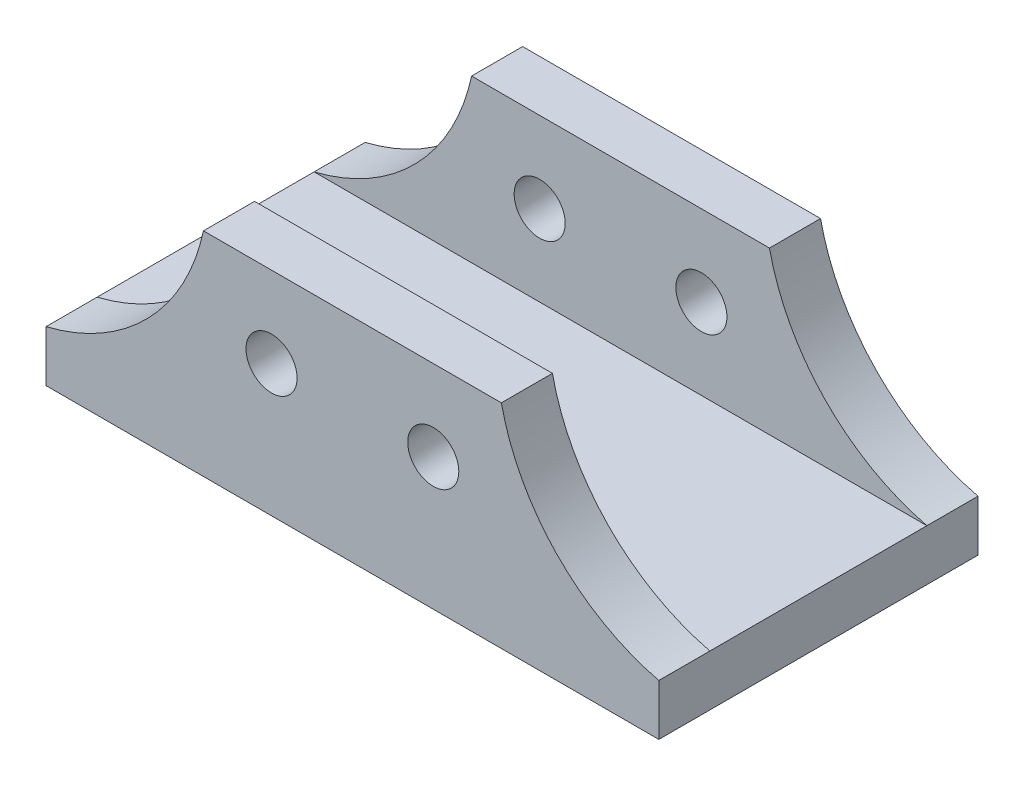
ISO-10303-21;
HEADER;
FILE_DESCRIPTION(('STEP AP214'),'2;1');
FILE_NAME('part.step','',(''),(''),'','','');
FILE_SCHEMA(('AUTOMOTIVE_DESIGN { 1 0 10303 214 1 1 1 1 }'));
ENDSEC;
DATA;
#1=APPLICATION_CONTEXT('core data for automotive mechanical design processes');
#2=APPLICATION_PROTOCOL_DEFINITION('international standard','automotive_design',2000,#1);
#3=PRODUCT_CONTEXT('',#1,'mechanical');
#4=PRODUCT('Part','Part','',(#3));
#5=PRODUCT_RELATED_PRODUCT_CATEGORY('part','',(#4));
#6=PRODUCT_DEFINITION_FORMATION('','',#4);
#7=PRODUCT_DEFINITION_CONTEXT('part definition',#1,'design');
#8=PRODUCT_DEFINITION('design','',#6,#7);
#9=PRODUCT_DEFINITION_SHAPE('','',#8);
#10=(LENGTH_UNIT() NAMED_UNIT(*) SI_UNIT(.MILLI.,.METRE.));
#11=(NAMED_UNIT(*) PLANE_ANGLE_UNIT() SI_UNIT($,.RADIAN.));
#12=(NAMED_UNIT(*) SI_UNIT($,.STERADIAN.) SOLID_ANGLE_UNIT());
#13=UNCERTAINTY_MEASURE_WITH_UNIT(LENGTH_MEASURE(1.E-05),#10,'distance_accuracy_value','');
#14=(GEOMETRIC_REPRESENTATION_CONTEXT(3) GLOBAL_UNCERTAINTY_ASSIGNED_CONTEXT((#13)) GLOBAL_UNIT_ASSIGNED_CONTEXT((#10,
#11,#12)) REPRESENTATION_CONTEXT('',''));
#15=CARTESIAN_POINT('',(0.,0.,0.));
#16=DIRECTION('',(0.,0.,1.));
#17=DIRECTION('',(1.,0.,0.));
#18=AXIS2_PLACEMENT_3D('',#15,#16,#17);
#19=CARTESIAN_POINT('',(83.8698437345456,60.5706373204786,12.));
#20=DIRECTION('',(0.,0.,-1.));
#21=DIRECTION('',(-1.,0.,0.));
#22=AXIS2_PLACEMENT_3D('',#19,#20,#21);
#23=PLANE('',#22);
#24=CARTESIAN_POINT('',(-19.,31.,12.));
#25=DIRECTION('',(0.,0.,1.));
#26=DIRECTION('',(-1.,0.,0.));
#27=AXIS2_PLACEMENT_3D('',#24,#25,#26);
#28=CIRCLE('',#27,6.00000000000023);
#29=CARTESIAN_POINT('',(-25.0000000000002,31.,12.));
#30=VERTEX_POINT('',#29);
#31=EDGE_CURVE('E182',#30,#30,#28,.T.);
#32=ORIENTED_EDGE('',*,*,#31,.F.);
#33=EDGE_LOOP('',(#32));
#34=FACE_BOUND('',#33,.T.);
#35=CARTESIAN_POINT('',(19.,31.,12.));
#36=DIRECTION('',(0.,0.,1.));
#37=DIRECTION('',(1.,0.,0.));
#38=AXIS2_PLACEMENT_3D('',#35,#36,#37);
#39=CIRCLE('',#38,6.00000000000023);
#40=CARTESIAN_POINT('',(25.0000000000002,31.,12.));
#41=VERTEX_POINT('',#40);
#42=EDGE_CURVE('E188',#41,#41,#39,.T.);
#43=ORIENTED_EDGE('',*,*,#42,.F.);
#44=EDGE_LOOP('',(#43));
#45=FACE_BOUND('',#44,.T.);
#46=DIRECTION('',(-1.,0.,0.));
#47=VECTOR('',#46,1.);
#48=CARTESIAN_POINT('',(-72.,12.,12.));
#49=LINE('',#48,#47);
#50=CARTESIAN_POINT('',(72.,12.,12.));
#51=VERTEX_POINT('',#50);
#52=CARTESIAN_POINT('',(-72.,12.,12.));
#53=VERTEX_POINT('',#52);
#54=EDGE_CURVE('E91',#51,#53,#49,.T.);
#55=ORIENTED_EDGE('',*,*,#54,.F.);
#56=CARTESIAN_POINT('',(83.8698437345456,60.5706373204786,12.));
#57=DIRECTION('',(0.,0.,-1.));
#58=DIRECTION('',(-1.,0.,0.));
#59=AXIS2_PLACEMENT_3D('',#56,#57,#58);
#60=CIRCLE('',#59,50.);
#61=CARTESIAN_POINT('',(35.,50.,12.));
#62=VERTEX_POINT('',#61);
#63=EDGE_CURVE('E194',#51,#62,#60,.T.);
#64=ORIENTED_EDGE('',*,*,#63,.T.);
#65=DIRECTION('',(-1.,0.,0.));
#66=VECTOR('',#65,1.);
#67=CARTESIAN_POINT('',(-35.,50.,12.));
#68=LINE('',#67,#66);
#69=CARTESIAN_POINT('',(-35.,50.,12.));
#70=VERTEX_POINT('',#69);
#71=EDGE_CURVE('E57',#62,#70,#68,.T.);
#72=ORIENTED_EDGE('',*,*,#71,.T.);
#73=CARTESIAN_POINT('',(-83.8698437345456,60.5706373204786,12.));
#74=DIRECTION('',(0.,0.,-1.));
#75=DIRECTION('',(1.,0.,0.));
#76=AXIS2_PLACEMENT_3D('',#73,#74,#75);
#77=CIRCLE('',#76,50.);
#78=EDGE_CURVE('E197',#70,#53,#77,.T.);
#79=ORIENTED_EDGE('',*,*,#78,.T.);
#80=EDGE_LOOP('',(#55,#64,#72,#79));
#81=FACE_BOUND('',#80,.T.);
#82=ADVANCED_FACE('F40',(#34,#45,#81),#23,.F.);
#83=CARTESIAN_POINT('',(83.8698437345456,60.5706373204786,0.));
#84=DIRECTION('',(0.,0.,-1.));
#85=DIRECTION('',(-1.,0.,0.));
#86=AXIS2_PLACEMENT_3D('',#83,#84,#85);
#87=PLANE('',#86);
#88=CARTESIAN_POINT('',(19.,31.,0.));
#89=DIRECTION('',(0.,0.,1.));
#90=DIRECTION('',(1.,0.,0.));
#91=AXIS2_PLACEMENT_3D('',#88,#89,#90);
#92=CIRCLE('',#91,6.00000000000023);
#93=CARTESIAN_POINT('',(25.0000000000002,31.,0.));
#94=VERTEX_POINT('',#93);
#95=EDGE_CURVE('E185',#94,#94,#92,.T.);
#96=ORIENTED_EDGE('',*,*,#95,.T.);
#97=EDGE_LOOP('',(#96));
#98=FACE_BOUND('',#97,.T.);
#99=DIRECTION('',(0.,1.,0.));
#100=VECTOR('',#99,1.);
#101=CARTESIAN_POINT('',(72.,0.,0.));
#102=LINE('',#101,#100);
#103=CARTESIAN_POINT('',(72.,0.,0.));
#104=VERTEX_POINT('',#103);
#105=CARTESIAN_POINT('',(72.,12.,0.));
#106=VERTEX_POINT('',#105);
#107=EDGE_CURVE('E191',#104,#106,#102,.T.);
#108=ORIENTED_EDGE('',*,*,#107,.F.);
#109=DIRECTION('',(1.,0.,0.));
#110=VECTOR('',#109,1.);
#111=CARTESIAN_POINT('',(-72.,0.,0.));
#112=LINE('',#111,#110);
#113=CARTESIAN_POINT('',(-72.,0.,0.));
#114=VERTEX_POINT('',#113);
#115=EDGE_CURVE('E87',#114,#104,#112,.T.);
#116=ORIENTED_EDGE('',*,*,#115,.F.);
#117=DIRECTION('',(0.,-1.,0.));
#118=VECTOR('',#117,1.);
#119=CARTESIAN_POINT('',(-72.,0.,0.));
#120=LINE('',#119,#118);
#121=CARTESIAN_POINT('',(-72.,12.,0.));
#122=VERTEX_POINT('',#121);
#123=EDGE_CURVE('E81',#122,#114,#120,.T.);
#124=ORIENTED_EDGE('',*,*,#123,.F.);
#125=CARTESIAN_POINT('',(-83.8698437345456,60.5706373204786,0.));
#126=DIRECTION('',(0.,0.,-1.));
#127=DIRECTION('',(1.,0.,0.));
#128=AXIS2_PLACEMENT_3D('',#125,#126,#127);
#129=CIRCLE('',#128,50.);
#130=CARTESIAN_POINT('',(-35.,50.,0.));
#131=VERTEX_POINT('',#130);
#132=EDGE_CURVE('E206',#131,#122,#129,.T.);
#133=ORIENTED_EDGE('',*,*,#132,.F.);
#134=DIRECTION('',(-1.,0.,0.));
#135=VECTOR('',#134,1.);
#136=CARTESIAN_POINT('',(-35.,50.,0.));
#137=LINE('',#136,#135);
#138=CARTESIAN_POINT('',(35.,50.,0.));
#139=VERTEX_POINT('',#138);
#140=EDGE_CURVE('E204',#139,#131,#137,.T.);
#141=ORIENTED_EDGE('',*,*,#140,.F.);
#142=CARTESIAN_POINT('',(83.8698437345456,60.5706373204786,0.));
#143=DIRECTION('',(0.,0.,-1.));
#144=DIRECTION('',(-1.,0.,0.));
#145=AXIS2_PLACEMENT_3D('',#142,#143,#144);
#146=CIRCLE('',#145,50.);
#147=EDGE_CURVE('E202',#106,#139,#146,.T.);
#148=ORIENTED_EDGE('',*,*,#147,.F.);
#149=EDGE_LOOP('',(#108,#116,#124,#133,#141,#148));
#150=FACE_BOUND('',#149,.T.);
#151=CARTESIAN_POINT('',(-19.,31.,0.));
#152=DIRECTION('',(0.,0.,1.));
#153=DIRECTION('',(-1.,0.,0.));
#154=AXIS2_PLACEMENT_3D('',#151,#152,#153);
#155=CIRCLE('',#154,6.00000000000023);
#156=CARTESIAN_POINT('',(-25.0000000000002,31.,0.));
#157=VERTEX_POINT('',#156);
#158=EDGE_CURVE('E180',#157,#157,#155,.T.);
#159=ORIENTED_EDGE('',*,*,#158,.T.);
#160=EDGE_LOOP('',(#159));
#161=FACE_BOUND('',#160,.T.);
#162=ADVANCED_FACE('F226',(#98,#150,#161),#87,.T.);
#163=CARTESIAN_POINT('',(72.,0.,12.));
#164=DIRECTION('',(-1.,0.,0.));
#165=DIRECTION('',(0.,0.,1.));
#166=AXIS2_PLACEMENT_3D('',#163,#164,#165);
#167=PLANE('',#166);
#168=ORIENTED_EDGE('',*,*,#107,.T.);
#169=DIRECTION('',(0.,0.,-1.));
#170=VECTOR('',#169,1.);
#171=CARTESIAN_POINT('',(72.,12.,12.));
#172=LINE('',#171,#170);
#173=EDGE_CURVE('E11',#51,#106,#172,.T.);
#174=ORIENTED_EDGE('',*,*,#173,.F.);
#175=DIRECTION('',(0.,0.,1.));
#176=VECTOR('',#175,1.);
#177=CARTESIAN_POINT('',(72.,12.,-132.499134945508));
#178=LINE('',#177,#176);
#179=CARTESIAN_POINT('',(72.,12.,63.));
#180=VERTEX_POINT('',#179);
#181=EDGE_CURVE('E176',#51,#180,#178,.T.);
#182=ORIENTED_EDGE('',*,*,#181,.T.);
#183=DIRECTION('',(0.,0.,1.));
#184=VECTOR('',#183,1.);
#185=CARTESIAN_POINT('',(72.,12.,63.));
#186=LINE('',#185,#184);
#187=CARTESIAN_POINT('',(72.,12.,75.));
#188=VERTEX_POINT('',#187);
#189=EDGE_CURVE('E137',#180,#188,#186,.T.);
#190=ORIENTED_EDGE('',*,*,#189,.T.);
#191=DIRECTION('',(0.,1.,0.));
#192=VECTOR('',#191,1.);
#193=CARTESIAN_POINT('',(72.,0.,75.));
#194=LINE('',#193,#192);
#195=CARTESIAN_POINT('',(72.,0.,75.));
#196=VERTEX_POINT('',#195);
#197=EDGE_CURVE('E156',#196,#188,#194,.T.);
#198=ORIENTED_EDGE('',*,*,#197,.F.);
#199=DIRECTION('',(0.,0.,-1.));
#200=VECTOR('',#199,1.);
#201=CARTESIAN_POINT('',(72.,0.,12.));
#202=LINE('',#201,#200);
#203=EDGE_CURVE('E199',#196,#104,#202,.T.);
#204=ORIENTED_EDGE('',*,*,#203,.T.);
#205=EDGE_LOOP('',(#168,#174,#182,#190,#198,#204));
#206=FACE_BOUND('',#205,.T.);
#207=ADVANCED_FACE('F42',(#206),#167,.F.);
#208=CARTESIAN_POINT('',(83.8698437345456,60.5706373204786,12.));
#209=DIRECTION('',(0.,0.,-1.));
#210=DIRECTION('',(-1.,0.,0.));
#211=AXIS2_PLACEMENT_3D('',#208,#209,#210);
#212=CYLINDRICAL_SURFACE('',#211,50.);
#213=ORIENTED_EDGE('',*,*,#147,.T.);
#214=DIRECTION('',(0.,0.,-1.));
#215=VECTOR('',#214,1.);
#216=CARTESIAN_POINT('',(35.,50.,12.));
#217=LINE('',#216,#215);
#218=EDGE_CURVE('E49',#62,#139,#217,.T.);
#219=ORIENTED_EDGE('',*,*,#218,.F.);
#220=ORIENTED_EDGE('',*,*,#63,.F.);
#221=ORIENTED_EDGE('',*,*,#173,.T.);
#222=EDGE_LOOP('',(#213,#219,#220,#221));
#223=FACE_BOUND('',#222,.T.);
#224=ADVANCED_FACE('F242',(#223),#212,.F.);
#225=CARTESIAN_POINT('',(-35.,50.,12.));
#226=DIRECTION('',(0.,-1.,0.));
#227=DIRECTION('',(0.,0.,-1.));
#228=AXIS2_PLACEMENT_3D('',#225,#226,#227);
#229=PLANE('',#228);
#230=ORIENTED_EDGE('',*,*,#140,.T.);
#231=DIRECTION('',(0.,0.,-1.));
#232=VECTOR('',#231,1.);
#233=CARTESIAN_POINT('',(-35.,50.,12.));
#234=LINE('',#233,#232);
#235=EDGE_CURVE('E215',#70,#131,#234,.T.);
#236=ORIENTED_EDGE('',*,*,#235,.F.);
#237=ORIENTED_EDGE('',*,*,#71,.F.);
#238=ORIENTED_EDGE('',*,*,#218,.T.);
#239=EDGE_LOOP('',(#230,#236,#237,#238));
#240=FACE_BOUND('',#239,.T.);
#241=ADVANCED_FACE('F221',(#240),#229,.F.);
#242=CARTESIAN_POINT('',(-83.8698437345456,60.5706373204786,12.));
#243=DIRECTION('',(0.,0.,-1.));
#244=DIRECTION('',(-1.,0.,0.));
#245=AXIS2_PLACEMENT_3D('',#242,#243,#244);
#246=CYLINDRICAL_SURFACE('',#245,50.);
#247=ORIENTED_EDGE('',*,*,#132,.T.);
#248=DIRECTION('',(0.,0.,-1.));
#249=VECTOR('',#248,1.);
#250=CARTESIAN_POINT('',(-72.,12.,12.));
#251=LINE('',#250,#249);
#252=EDGE_CURVE('E213',#53,#122,#251,.T.);
#253=ORIENTED_EDGE('',*,*,#252,.F.);
#254=ORIENTED_EDGE('',*,*,#78,.F.);
#255=ORIENTED_EDGE('',*,*,#235,.T.);
#256=EDGE_LOOP('',(#247,#253,#254,#255));
#257=FACE_BOUND('',#256,.T.);
#258=ADVANCED_FACE('F229',(#257),#246,.F.);
#259=CARTESIAN_POINT('',(-72.,0.,12.));
#260=DIRECTION('',(1.,0.,0.));
#261=DIRECTION('',(0.,0.,-1.));
#262=AXIS2_PLACEMENT_3D('',#259,#260,#261);
#263=PLANE('',#262);
#264=ORIENTED_EDGE('',*,*,#123,.T.);
#265=DIRECTION('',(0.,0.,-1.));
#266=VECTOR('',#265,1.);
#267=CARTESIAN_POINT('',(-72.,0.,12.));
#268=LINE('',#267,#266);
#269=CARTESIAN_POINT('',(-72.,0.,75.));
#270=VERTEX_POINT('',#269);
#271=EDGE_CURVE('E211',#270,#114,#268,.T.);
#272=ORIENTED_EDGE('',*,*,#271,.F.);
#273=DIRECTION('',(0.,-1.,0.));
#274=VECTOR('',#273,1.);
#275=CARTESIAN_POINT('',(-72.,0.,75.));
#276=LINE('',#275,#274);
#277=CARTESIAN_POINT('',(-72.,12.,75.));
#278=VERTEX_POINT('',#277);
#279=EDGE_CURVE('E166',#278,#270,#276,.T.);
#280=ORIENTED_EDGE('',*,*,#279,.F.);
#281=DIRECTION('',(0.,0.,1.));
#282=VECTOR('',#281,1.);
#283=CARTESIAN_POINT('',(-72.,12.,63.));
#284=LINE('',#283,#282);
#285=CARTESIAN_POINT('',(-72.,12.,63.));
#286=VERTEX_POINT('',#285);
#287=EDGE_CURVE('E152',#286,#278,#284,.T.);
#288=ORIENTED_EDGE('',*,*,#287,.F.);
#289=DIRECTION('',(0.,0.,1.));
#290=VECTOR('',#289,1.);
#291=CARTESIAN_POINT('',(-72.,12.,-132.499134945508));
#292=LINE('',#291,#290);
#293=EDGE_CURVE('E178',#53,#286,#292,.T.);
#294=ORIENTED_EDGE('',*,*,#293,.F.);
#295=ORIENTED_EDGE('',*,*,#252,.T.);
#296=EDGE_LOOP('',(#264,#272,#280,#288,#294,#295));
#297=FACE_BOUND('',#296,.T.);
#298=ADVANCED_FACE('F232',(#297),#263,.F.);
#299=CARTESIAN_POINT('',(-72.,0.,12.));
#300=DIRECTION('',(0.,1.,0.));
#301=DIRECTION('',(0.,0.,1.));
#302=AXIS2_PLACEMENT_3D('',#299,#300,#301);
#303=PLANE('',#302);
#304=ORIENTED_EDGE('',*,*,#115,.T.);
#305=ORIENTED_EDGE('',*,*,#203,.F.);
#306=DIRECTION('',(1.,0.,0.));
#307=VECTOR('',#306,1.);
#308=CARTESIAN_POINT('',(-72.,0.,75.));
#309=LINE('',#308,#307);
#310=EDGE_CURVE('E146',#270,#196,#309,.T.);
#311=ORIENTED_EDGE('',*,*,#310,.F.);
#312=ORIENTED_EDGE('',*,*,#271,.T.);
#313=EDGE_LOOP('',(#304,#305,#311,#312));
#314=FACE_BOUND('',#313,.T.);
#315=ADVANCED_FACE('F257',(#314),#303,.F.);
#316=CARTESIAN_POINT('',(19.,31.,12.));
#317=DIRECTION('',(0.,0.,-1.));
#318=DIRECTION('',(-1.,0.,0.));
#319=AXIS2_PLACEMENT_3D('',#316,#317,#318);
#320=CYLINDRICAL_SURFACE('',#319,6.00000000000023);
#321=ORIENTED_EDGE('',*,*,#42,.T.);
#322=EDGE_LOOP('',(#321));
#323=FACE_BOUND('',#322,.T.);
#324=ORIENTED_EDGE('',*,*,#95,.F.);
#325=EDGE_LOOP('',(#324));
#326=FACE_BOUND('',#325,.T.);
#327=ADVANCED_FACE('F254',(#323,#326),#320,.F.);
#328=CARTESIAN_POINT('',(-19.,31.,12.));
#329=DIRECTION('',(0.,0.,-1.));
#330=DIRECTION('',(-1.,0.,0.));
#331=AXIS2_PLACEMENT_3D('',#328,#329,#330);
#332=CYLINDRICAL_SURFACE('',#331,6.00000000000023);
#333=ORIENTED_EDGE('',*,*,#31,.T.);
#334=EDGE_LOOP('',(#333));
#335=FACE_BOUND('',#334,.T.);
#336=ORIENTED_EDGE('',*,*,#158,.F.);
#337=EDGE_LOOP('',(#336));
#338=FACE_BOUND('',#337,.T.);
#339=ADVANCED_FACE('F284',(#335,#338),#332,.F.);
#340=CARTESIAN_POINT('',(-72.,12.,-132.499134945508));
#341=DIRECTION('',(0.,1.,0.));
#342=DIRECTION('',(0.,0.,1.));
#343=AXIS2_PLACEMENT_3D('',#340,#341,#342);
#344=PLANE('',#343);
#345=ORIENTED_EDGE('',*,*,#181,.F.);
#346=ORIENTED_EDGE('',*,*,#54,.T.);
#347=ORIENTED_EDGE('',*,*,#293,.T.);
#348=DIRECTION('',(-1.,0.,0.));
#349=VECTOR('',#348,1.);
#350=CARTESIAN_POINT('',(-72.,12.,63.));
#351=LINE('',#350,#349);
#352=EDGE_CURVE('E174',#180,#286,#351,.T.);
#353=ORIENTED_EDGE('',*,*,#352,.F.);
#354=EDGE_LOOP('',(#345,#346,#347,#353));
#355=FACE_BOUND('',#354,.T.);
#356=ADVANCED_FACE('F238',(#355),#344,.T.);
#357=CARTESIAN_POINT('',(83.8698437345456,60.5706373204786,63.));
#358=DIRECTION('',(0.,0.,1.));
#359=DIRECTION('',(-1.,0.,0.));
#360=AXIS2_PLACEMENT_3D('',#357,#358,#359);
#361=PLANE('',#360);
#362=CARTESIAN_POINT('',(19.,31.,63.));
#363=DIRECTION('',(0.,0.,1.));
#364=DIRECTION('',(1.,0.,0.));
#365=AXIS2_PLACEMENT_3D('',#362,#363,#364);
#366=CIRCLE('',#365,6.00000000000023);
#367=CARTESIAN_POINT('',(25.0000000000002,31.,63.));
#368=VERTEX_POINT('',#367);
#369=EDGE_CURVE('E160',#368,#368,#366,.T.);
#370=ORIENTED_EDGE('',*,*,#369,.T.);
#371=EDGE_LOOP('',(#370));
#372=FACE_BOUND('',#371,.T.);
#373=CARTESIAN_POINT('',(-19.,31.,63.));
#374=DIRECTION('',(0.,0.,1.));
#375=DIRECTION('',(-1.,0.,0.));
#376=AXIS2_PLACEMENT_3D('',#373,#374,#375);
#377=CIRCLE('',#376,6.00000000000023);
#378=CARTESIAN_POINT('',(-25.0000000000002,31.,63.));
#379=VERTEX_POINT('',#378);
#380=EDGE_CURVE('E469',#379,#379,#377,.T.);
#381=ORIENTED_EDGE('',*,*,#380,.T.);
#382=EDGE_LOOP('',(#381));
#383=FACE_BOUND('',#382,.T.);
#384=CARTESIAN_POINT('',(83.8698437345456,60.5706373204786,63.));
#385=DIRECTION('',(0.,0.,-1.));
#386=DIRECTION('',(-1.,0.,0.));
#387=AXIS2_PLACEMENT_3D('',#384,#385,#386);
#388=CIRCLE('',#387,50.);
#389=CARTESIAN_POINT('',(35.,50.,63.));
#390=VERTEX_POINT('',#389);
#391=EDGE_CURVE('E142',#180,#390,#388,.T.);
#392=ORIENTED_EDGE('',*,*,#391,.F.);
#393=ORIENTED_EDGE('',*,*,#352,.T.);
#394=CARTESIAN_POINT('',(-83.8698437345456,60.5706373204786,63.));
#395=DIRECTION('',(0.,0.,-1.));
#396=DIRECTION('',(1.,0.,0.));
#397=AXIS2_PLACEMENT_3D('',#394,#395,#396);
#398=CIRCLE('',#397,50.);
#399=CARTESIAN_POINT('',(-35.,50.,63.));
#400=VERTEX_POINT('',#399);
#401=EDGE_CURVE('E150',#400,#286,#398,.T.);
#402=ORIENTED_EDGE('',*,*,#401,.F.);
#403=DIRECTION('',(-1.,0.,0.));
#404=VECTOR('',#403,1.);
#405=CARTESIAN_POINT('',(-35.,50.,63.));
#406=LINE('',#405,#404);
#407=EDGE_CURVE('E130',#390,#400,#406,.T.);
#408=ORIENTED_EDGE('',*,*,#407,.F.);
#409=EDGE_LOOP('',(#392,#393,#402,#408));
#410=FACE_BOUND('',#409,.T.);
#411=ADVANCED_FACE('F148',(#372,#383,#410),#361,.F.);
#412=CARTESIAN_POINT('',(83.8698437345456,60.5706373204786,75.));
#413=DIRECTION('',(0.,0.,1.));
#414=DIRECTION('',(-1.,0.,0.));
#415=AXIS2_PLACEMENT_3D('',#412,#413,#414);
#416=PLANE('',#415);
#417=CARTESIAN_POINT('',(19.,31.,75.));
#418=DIRECTION('',(0.,0.,1.));
#419=DIRECTION('',(1.,0.,0.));
#420=AXIS2_PLACEMENT_3D('',#417,#418,#419);
#421=CIRCLE('',#420,6.00000000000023);
#422=CARTESIAN_POINT('',(25.0000000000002,31.,75.));
#423=VERTEX_POINT('',#422);
#424=EDGE_CURVE('E475',#423,#423,#421,.T.);
#425=ORIENTED_EDGE('',*,*,#424,.F.);
#426=EDGE_LOOP('',(#425));
#427=FACE_BOUND('',#426,.T.);
#428=ORIENTED_EDGE('',*,*,#197,.T.);
#429=CARTESIAN_POINT('',(83.8698437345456,60.5706373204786,75.));
#430=DIRECTION('',(0.,0.,-1.));
#431=DIRECTION('',(-1.,0.,0.));
#432=AXIS2_PLACEMENT_3D('',#429,#430,#431);
#433=CIRCLE('',#432,50.);
#434=CARTESIAN_POINT('',(35.,50.,75.));
#435=VERTEX_POINT('',#434);
#436=EDGE_CURVE('E159',#188,#435,#433,.T.);
#437=ORIENTED_EDGE('',*,*,#436,.T.);
#438=DIRECTION('',(-1.,0.,0.));
#439=VECTOR('',#438,1.);
#440=CARTESIAN_POINT('',(-35.,50.,75.));
#441=LINE('',#440,#439);
#442=CARTESIAN_POINT('',(-35.,50.,75.));
#443=VERTEX_POINT('',#442);
#444=EDGE_CURVE('E133',#435,#443,#441,.T.);
#445=ORIENTED_EDGE('',*,*,#444,.T.);
#446=CARTESIAN_POINT('',(-83.8698437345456,60.5706373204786,75.));
#447=DIRECTION('',(0.,0.,-1.));
#448=DIRECTION('',(1.,0.,0.));
#449=AXIS2_PLACEMENT_3D('',#446,#447,#448);
#450=CIRCLE('',#449,50.);
#451=EDGE_CURVE('E163',#443,#278,#450,.T.);
#452=ORIENTED_EDGE('',*,*,#451,.T.);
#453=ORIENTED_EDGE('',*,*,#279,.T.);
#454=ORIENTED_EDGE('',*,*,#310,.T.);
#455=EDGE_LOOP('',(#428,#437,#445,#452,#453,#454));
#456=FACE_BOUND('',#455,.T.);
#457=CARTESIAN_POINT('',(-19.,31.,75.));
#458=DIRECTION('',(0.,0.,1.));
#459=DIRECTION('',(-1.,0.,0.));
#460=AXIS2_PLACEMENT_3D('',#457,#458,#459);
#461=CIRCLE('',#460,6.00000000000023);
#462=CARTESIAN_POINT('',(-25.0000000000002,31.,75.));
#463=VERTEX_POINT('',#462);
#464=EDGE_CURVE('E472',#463,#463,#461,.T.);
#465=ORIENTED_EDGE('',*,*,#464,.F.);
#466=EDGE_LOOP('',(#465));
#467=FACE_BOUND('',#466,.T.);
#468=ADVANCED_FACE('F298',(#427,#456,#467),#416,.T.);
#469=CARTESIAN_POINT('',(83.8698437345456,60.5706373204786,63.));
#470=DIRECTION('',(0.,0.,1.));
#471=DIRECTION('',(-1.,0.,0.));
#472=AXIS2_PLACEMENT_3D('',#469,#470,#471);
#473=CYLINDRICAL_SURFACE('',#472,50.);
#474=ORIENTED_EDGE('',*,*,#436,.F.);
#475=ORIENTED_EDGE('',*,*,#189,.F.);
#476=ORIENTED_EDGE('',*,*,#391,.T.);
#477=DIRECTION('',(0.,0.,1.));
#478=VECTOR('',#477,1.);
#479=CARTESIAN_POINT('',(35.,50.,63.));
#480=LINE('',#479,#478);
#481=EDGE_CURVE('E126',#390,#435,#480,.T.);
#482=ORIENTED_EDGE('',*,*,#481,.T.);
#483=EDGE_LOOP('',(#474,#475,#476,#482));
#484=FACE_BOUND('',#483,.T.);
#485=ADVANCED_FACE('F143',(#484),#473,.F.);
#486=CARTESIAN_POINT('',(-35.,50.,63.));
#487=DIRECTION('',(0.,-1.,0.));
#488=DIRECTION('',(0.,0.,1.));
#489=AXIS2_PLACEMENT_3D('',#486,#487,#488);
#490=PLANE('',#489);
#491=ORIENTED_EDGE('',*,*,#444,.F.);
#492=ORIENTED_EDGE('',*,*,#481,.F.);
#493=ORIENTED_EDGE('',*,*,#407,.T.);
#494=DIRECTION('',(0.,0.,1.));
#495=VECTOR('',#494,1.);
#496=CARTESIAN_POINT('',(-35.,50.,63.));
#497=LINE('',#496,#495);
#498=EDGE_CURVE('E138',#400,#443,#497,.T.);
#499=ORIENTED_EDGE('',*,*,#498,.T.);
#500=EDGE_LOOP('',(#491,#492,#493,#499));
#501=FACE_BOUND('',#500,.T.);
#502=ADVANCED_FACE('F128',(#501),#490,.F.);
#503=CARTESIAN_POINT('',(-83.8698437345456,60.5706373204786,63.));
#504=DIRECTION('',(0.,0.,1.));
#505=DIRECTION('',(-1.,0.,0.));
#506=AXIS2_PLACEMENT_3D('',#503,#504,#505);
#507=CYLINDRICAL_SURFACE('',#506,50.);
#508=ORIENTED_EDGE('',*,*,#451,.F.);
#509=ORIENTED_EDGE('',*,*,#498,.F.);
#510=ORIENTED_EDGE('',*,*,#401,.T.);
#511=ORIENTED_EDGE('',*,*,#287,.T.);
#512=EDGE_LOOP('',(#508,#509,#510,#511));
#513=FACE_BOUND('',#512,.T.);
#514=ADVANCED_FACE('F319',(#513),#507,.F.);
#515=CARTESIAN_POINT('',(19.,31.,63.));
#516=DIRECTION('',(0.,0.,1.));
#517=DIRECTION('',(-1.,0.,0.));
#518=AXIS2_PLACEMENT_3D('',#515,#516,#517);
#519=CYLINDRICAL_SURFACE('',#518,6.00000000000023);
#520=ORIENTED_EDGE('',*,*,#369,.F.);
#521=EDGE_LOOP('',(#520));
#522=FACE_BOUND('',#521,.T.);
#523=ORIENTED_EDGE('',*,*,#424,.T.);
#524=EDGE_LOOP('',(#523));
#525=FACE_BOUND('',#524,.T.);
#526=ADVANCED_FACE('F326',(#522,#525),#519,.F.);
#527=CARTESIAN_POINT('',(-19.,31.,63.));
#528=DIRECTION('',(0.,0.,1.));
#529=DIRECTION('',(-1.,0.,0.));
#530=AXIS2_PLACEMENT_3D('',#527,#528,#529);
#531=CYLINDRICAL_SURFACE('',#530,6.00000000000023);
#532=ORIENTED_EDGE('',*,*,#380,.F.);
#533=EDGE_LOOP('',(#532));
#534=FACE_BOUND('',#533,.T.);
#535=ORIENTED_EDGE('',*,*,#464,.T.);
#536=EDGE_LOOP('',(#535));
#537=FACE_BOUND('',#536,.T.);
#538=ADVANCED_FACE('F334',(#534,#537),#531,.F.);
#539=CLOSED_SHELL('',(#82,#162,#207,#224,#241,#258,#298,#315,#327,#339,#356,#411,#468,#485,#502,
#514,#526,#538));
#540=MANIFOLD_SOLID_BREP('B2',#539);
#541=ADVANCED_BREP_SHAPE_REPRESENTATION('',(#18,#540),#14);
#542=SHAPE_DEFINITION_REPRESENTATION(#9,#541);
ENDSEC;
END-ISO-10303-21;
